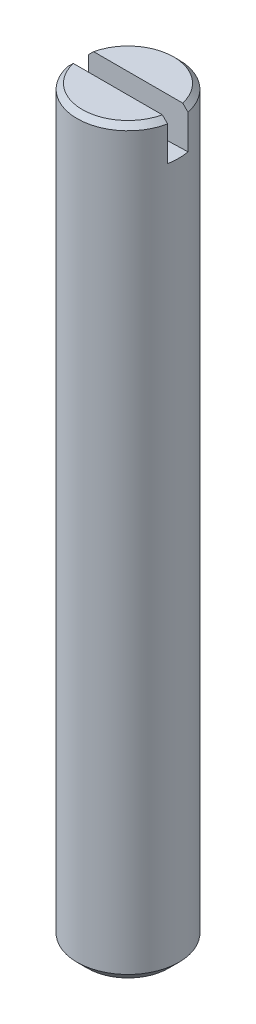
ISO-10303-21;
HEADER;
FILE_DESCRIPTION(('STEP AP214'),'2;1');
FILE_NAME('part.step','',(''),(''),'','','');
FILE_SCHEMA(('AUTOMOTIVE_DESIGN { 1 0 10303 214 1 1 1 1 }'));
ENDSEC;
DATA;
#1=APPLICATION_CONTEXT('core data for automotive mechanical design processes');
#2=APPLICATION_PROTOCOL_DEFINITION('international standard','automotive_design',2000,#1);
#3=PRODUCT_CONTEXT('',#1,'mechanical');
#4=PRODUCT('Part','Part','',(#3));
#5=PRODUCT_RELATED_PRODUCT_CATEGORY('part','',(#4));
#6=PRODUCT_DEFINITION_FORMATION('','',#4);
#7=PRODUCT_DEFINITION_CONTEXT('part definition',#1,'design');
#8=PRODUCT_DEFINITION('design','',#6,#7);
#9=PRODUCT_DEFINITION_SHAPE('','',#8);
#10=(LENGTH_UNIT() NAMED_UNIT(*) SI_UNIT(.MILLI.,.METRE.));
#11=(NAMED_UNIT(*) PLANE_ANGLE_UNIT() SI_UNIT($,.RADIAN.));
#12=(NAMED_UNIT(*) SI_UNIT($,.STERADIAN.) SOLID_ANGLE_UNIT());
#13=UNCERTAINTY_MEASURE_WITH_UNIT(LENGTH_MEASURE(1.E-05),#10,'distance_accuracy_value','');
#14=(GEOMETRIC_REPRESENTATION_CONTEXT(3) GLOBAL_UNCERTAINTY_ASSIGNED_CONTEXT((#13)) GLOBAL_UNIT_ASSIGNED_CONTEXT((#10,
#11,#12)) REPRESENTATION_CONTEXT('',''));
#15=CARTESIAN_POINT('',(0.,0.,0.));
#16=DIRECTION('',(0.,0.,1.));
#17=DIRECTION('',(1.,0.,0.));
#18=AXIS2_PLACEMENT_3D('',#15,#16,#17);
#19=CARTESIAN_POINT('',(0.,52.3,0.3));
#20=DIRECTION('',(0.,0.,-1.));
#21=DIRECTION('',(-1.,0.,0.));
#22=AXIS2_PLACEMENT_3D('',#19,#20,#21);
#23=CYLINDRICAL_SURFACE('',#22,31.5);
#24=CARTESIAN_POINT('',(1.46969384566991,20.8343043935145,-0.3));
#25=CARTESIAN_POINT('',(1.47819327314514,20.8347020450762,-0.258385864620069));
#26=CARTESIAN_POINT('',(1.48491598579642,20.8350188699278,-0.216408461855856));
#27=CARTESIAN_POINT('',(1.49478157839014,20.8354856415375,-0.132020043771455));
#28=CARTESIAN_POINT('',(1.49792328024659,20.8356355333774,-0.0896088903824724));
#29=CARTESIAN_POINT('',(1.50057258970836,20.8357618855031,-0.00538043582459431));
#30=CARTESIAN_POINT('',(1.50013980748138,20.8357411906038,0.036435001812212));
#31=CARTESIAN_POINT('',(1.49578575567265,20.8355338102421,0.119866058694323));
#32=CARTESIAN_POINT('',(1.49186606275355,20.835347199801,0.161481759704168));
#33=CARTESIAN_POINT('',(1.48177716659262,20.8348708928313,0.235411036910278));
#34=CARTESIAN_POINT('',(1.47626595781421,20.8346116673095,0.267815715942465));
#35=CARTESIAN_POINT('',(1.46969384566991,20.8343043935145,0.3));
#36=B_SPLINE_CURVE_WITH_KNOTS('',3,(#24,#25,#26,#27,#28,#29,#30,#31,#32,#33,#34,#35),
.UNSPECIFIED.,.F.,.F.,(4,2,2,2,2,4),(0.,0.127386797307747,0.254815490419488,0.380123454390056,
0.505374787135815,0.603915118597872),.UNSPECIFIED.);
#37=CARTESIAN_POINT('',(1.46969384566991,20.8343043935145,-0.3));
#38=VERTEX_POINT('',#37);
#39=CARTESIAN_POINT('',(1.46969384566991,20.8343043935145,0.3));
#40=VERTEX_POINT('',#39);
#41=EDGE_CURVE('E81',#38,#40,#36,.T.);
#42=ORIENTED_EDGE('',*,*,#41,.F.);
#43=CARTESIAN_POINT('',(0.,52.3,-0.3));
#44=DIRECTION('',(0.,0.,-1.));
#45=DIRECTION('',(-1.,0.,0.));
#46=AXIS2_PLACEMENT_3D('',#43,#44,#45);
#47=CIRCLE('',#46,31.5);
#48=CARTESIAN_POINT('',(-1.46969384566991,20.8343043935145,-0.3));
#49=VERTEX_POINT('',#48);
#50=EDGE_CURVE('E87',#49,#38,#47,.F.);
#51=ORIENTED_EDGE('',*,*,#50,.F.);
#52=CARTESIAN_POINT('',(-1.46969384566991,20.8343043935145,0.3));
#53=CARTESIAN_POINT('',(-1.47819327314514,20.8347020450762,0.258385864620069));
#54=CARTESIAN_POINT('',(-1.48491598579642,20.8350188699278,0.216408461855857));
#55=CARTESIAN_POINT('',(-1.49478157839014,20.8354856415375,0.132020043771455));
#56=CARTESIAN_POINT('',(-1.49792328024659,20.8356355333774,0.089608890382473));
#57=CARTESIAN_POINT('',(-1.50057258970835,20.8357618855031,0.00538043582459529));
#58=CARTESIAN_POINT('',(-1.50013980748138,20.8357411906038,-0.0364350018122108));
#59=CARTESIAN_POINT('',(-1.49578575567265,20.8355338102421,-0.119866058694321));
#60=CARTESIAN_POINT('',(-1.49186606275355,20.835347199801,-0.161481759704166));
#61=CARTESIAN_POINT('',(-1.48177716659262,20.8348708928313,-0.235411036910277));
#62=CARTESIAN_POINT('',(-1.47626595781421,20.8346116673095,-0.267815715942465));
#63=CARTESIAN_POINT('',(-1.46969384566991,20.8343043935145,-0.3));
#64=B_SPLINE_CURVE_WITH_KNOTS('',3,(#52,#53,#54,#55,#56,#57,#58,#59,#60,#61,#62,#63),
.UNSPECIFIED.,.F.,.F.,(4,2,2,2,2,4),(0.,0.127386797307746,0.254815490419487,0.380123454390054,
0.505374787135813,0.603915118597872),.UNSPECIFIED.);
#65=CARTESIAN_POINT('',(-1.46969384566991,20.8343043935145,0.3));
#66=VERTEX_POINT('',#65);
#67=EDGE_CURVE('E18',#66,#49,#64,.T.);
#68=ORIENTED_EDGE('',*,*,#67,.F.);
#69=CARTESIAN_POINT('',(0.,52.3,0.3));
#70=DIRECTION('',(0.,0.,-1.));
#71=DIRECTION('',(-1.,0.,0.));
#72=AXIS2_PLACEMENT_3D('',#69,#70,#71);
#73=CIRCLE('',#72,31.5);
#74=EDGE_CURVE('E80',#66,#40,#73,.F.);
#75=ORIENTED_EDGE('',*,*,#74,.T.);
#76=EDGE_LOOP('',(#42,#51,#68,#75));
#77=FACE_BOUND('',#76,.T.);
#78=ADVANCED_FACE('F14',(#77),#23,.F.);
#79=CARTESIAN_POINT('',(0.,52.3,0.3));
#80=DIRECTION('',(0.,0.,1.));
#81=DIRECTION('',(1.,0.,0.));
#82=AXIS2_PLACEMENT_3D('',#79,#80,#81);
#83=PLANE('',#82);
#84=DIRECTION('',(1.,0.,0.));
#85=VECTOR('',#84,1.);
#86=CARTESIAN_POINT('',(0.,22.,0.3));
#87=LINE('',#86,#85);
#88=CARTESIAN_POINT('',(-1.31265465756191,21.9999999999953,0.3));
#89=VERTEX_POINT('',#88);
#90=CARTESIAN_POINT('',(1.31265465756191,21.9999999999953,0.3));
#91=VERTEX_POINT('',#90);
#92=EDGE_CURVE('E156',#89,#91,#87,.T.);
#93=ORIENTED_EDGE('',*,*,#92,.T.);
#94=CARTESIAN_POINT('',(1.4696938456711,21.8465000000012,0.3));
#95=CARTESIAN_POINT('',(1.44355281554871,21.872116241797,0.3));
#96=CARTESIAN_POINT('',(1.41739570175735,21.8977160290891,0.3));
#97=CARTESIAN_POINT('',(1.36504930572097,21.9488826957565,0.3));
#98=CARTESIAN_POINT('',(1.33886002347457,21.9744495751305,0.3));
#99=CARTESIAN_POINT('',(1.31265465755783,21.9999999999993,0.3));
#100=B_SPLINE_CURVE_WITH_KNOTS('',3,(#94,#95,#96,#97,#98,#99),.UNSPECIFIED.,.F.,.F.,(4,2,4),(0.,
0.109799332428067,0.219598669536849),.UNSPECIFIED.);
#101=CARTESIAN_POINT('',(1.46969384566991,21.8465000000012,0.3));
#102=VERTEX_POINT('',#101);
#103=EDGE_CURVE('E94',#102,#91,#100,.T.);
#104=ORIENTED_EDGE('',*,*,#103,.F.);
#105=DIRECTION('',(0.,1.,0.));
#106=VECTOR('',#105,1.);
#107=CARTESIAN_POINT('',(1.46969384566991,52.3,0.3));
#108=LINE('',#107,#106);
#109=EDGE_CURVE('E92',#40,#102,#108,.T.);
#110=ORIENTED_EDGE('',*,*,#109,.F.);
#111=ORIENTED_EDGE('',*,*,#74,.F.);
#112=DIRECTION('',(0.,1.,0.));
#113=VECTOR('',#112,1.);
#114=CARTESIAN_POINT('',(-1.46969384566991,52.3,0.3));
#115=LINE('',#114,#113);
#116=CARTESIAN_POINT('',(-1.4696938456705,21.8465000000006,0.3));
#117=VERTEX_POINT('',#116);
#118=EDGE_CURVE('E72',#117,#66,#115,.F.);
#119=ORIENTED_EDGE('',*,*,#118,.F.);
#120=CARTESIAN_POINT('',(-1.31265465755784,21.9999999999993,0.3));
#121=CARTESIAN_POINT('',(-1.33886002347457,21.9744495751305,0.3));
#122=CARTESIAN_POINT('',(-1.36504930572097,21.9488826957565,0.3));
#123=CARTESIAN_POINT('',(-1.41739570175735,21.8977160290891,0.3));
#124=CARTESIAN_POINT('',(-1.4435528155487,21.872116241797,0.3));
#125=CARTESIAN_POINT('',(-1.46969384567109,21.8465000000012,0.3));
#126=B_SPLINE_CURVE_WITH_KNOTS('',3,(#120,#121,#122,#123,#124,#125),.UNSPECIFIED.,.F.,.F.,(4,2,
4),(0.,0.109799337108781,0.219598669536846),.UNSPECIFIED.);
#127=EDGE_CURVE('E144',#89,#117,#126,.T.);
#128=ORIENTED_EDGE('',*,*,#127,.F.);
#129=EDGE_LOOP('',(#93,#104,#110,#111,#119,#128));
#130=FACE_BOUND('',#129,.T.);
#131=ADVANCED_FACE('F90',(#130),#83,.F.);
#132=CARTESIAN_POINT('',(0.,52.3,-0.3));
#133=DIRECTION('',(0.,0.,1.));
#134=DIRECTION('',(1.,0.,0.));
#135=AXIS2_PLACEMENT_3D('',#132,#133,#134);
#136=PLANE('',#135);
#137=DIRECTION('',(1.,0.,0.));
#138=VECTOR('',#137,1.);
#139=CARTESIAN_POINT('',(0.,22.,-0.3));
#140=LINE('',#139,#138);
#141=CARTESIAN_POINT('',(1.31265465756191,21.9999999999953,-0.3));
#142=VERTEX_POINT('',#141);
#143=CARTESIAN_POINT('',(-1.31265465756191,21.9999999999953,-0.3));
#144=VERTEX_POINT('',#143);
#145=EDGE_CURVE('E158',#142,#144,#140,.F.);
#146=ORIENTED_EDGE('',*,*,#145,.T.);
#147=CARTESIAN_POINT('',(-1.31265465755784,21.9999999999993,-0.3));
#148=CARTESIAN_POINT('',(-1.33886002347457,21.9744495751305,-0.3));
#149=CARTESIAN_POINT('',(-1.36504930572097,21.9488826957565,-0.3));
#150=CARTESIAN_POINT('',(-1.41739570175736,21.8977160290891,-0.3));
#151=CARTESIAN_POINT('',(-1.44355281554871,21.872116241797,-0.3));
#152=CARTESIAN_POINT('',(-1.4696938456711,21.8465000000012,-0.3));
#153=B_SPLINE_CURVE_WITH_KNOTS('',3,(#147,#148,#149,#150,#151,#152),.UNSPECIFIED.,.F.,.F.,(4,2,
4),(0.,0.109799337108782,0.219598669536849),.UNSPECIFIED.);
#154=CARTESIAN_POINT('',(-1.46969384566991,21.8465000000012,-0.3));
#155=VERTEX_POINT('',#154);
#156=EDGE_CURVE('E38',#144,#155,#153,.T.);
#157=ORIENTED_EDGE('',*,*,#156,.T.);
#158=DIRECTION('',(0.,1.,0.));
#159=VECTOR('',#158,1.);
#160=CARTESIAN_POINT('',(-1.46969384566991,52.3,-0.3));
#161=LINE('',#160,#159);
#162=EDGE_CURVE('E149',#155,#49,#161,.F.);
#163=ORIENTED_EDGE('',*,*,#162,.T.);
#164=ORIENTED_EDGE('',*,*,#50,.T.);
#165=DIRECTION('',(0.,1.,0.));
#166=VECTOR('',#165,1.);
#167=CARTESIAN_POINT('',(1.46969384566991,52.3,-0.3));
#168=LINE('',#167,#166);
#169=CARTESIAN_POINT('',(1.4696938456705,21.8465000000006,-0.3));
#170=VERTEX_POINT('',#169);
#171=EDGE_CURVE('E132',#38,#170,#168,.T.);
#172=ORIENTED_EDGE('',*,*,#171,.T.);
#173=CARTESIAN_POINT('',(1.46969384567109,21.8465000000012,-0.3));
#174=CARTESIAN_POINT('',(1.4435528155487,21.872116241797,-0.3));
#175=CARTESIAN_POINT('',(1.41739570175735,21.8977160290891,-0.3));
#176=CARTESIAN_POINT('',(1.36504930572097,21.9488826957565,-0.3));
#177=CARTESIAN_POINT('',(1.33886002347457,21.9744495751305,-0.3));
#178=CARTESIAN_POINT('',(1.31265465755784,21.9999999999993,-0.3));
#179=B_SPLINE_CURVE_WITH_KNOTS('',3,(#173,#174,#175,#176,#177,#178),.UNSPECIFIED.,.F.,.F.,(4,2,
4),(0.,0.109799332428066,0.219598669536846),.UNSPECIFIED.);
#180=EDGE_CURVE('E126',#170,#142,#179,.T.);
#181=ORIENTED_EDGE('',*,*,#180,.T.);
#182=EDGE_LOOP('',(#146,#157,#163,#164,#172,#181));
#183=FACE_BOUND('',#182,.T.);
#184=ADVANCED_FACE('F133',(#183),#136,.T.);
#185=CARTESIAN_POINT('',(1.1935,0.,0.));
#186=DIRECTION('',(0.,1.,0.));
#187=DIRECTION('',(0.,0.,1.));
#188=AXIS2_PLACEMENT_3D('',#185,#186,#187);
#189=PLANE('',#188);
#190=CARTESIAN_POINT('',(0.,0.,0.));
#191=DIRECTION('',(0.,1.,0.));
#192=DIRECTION('',(0.,0.,1.));
#193=AXIS2_PLACEMENT_3D('',#190,#191,#192);
#194=CIRCLE('',#193,1.19350000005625);
#195=CARTESIAN_POINT('',(0.,0.,1.19350000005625));
#196=VERTEX_POINT('',#195);
#197=EDGE_CURVE('E162',#196,#196,#194,.T.);
#198=ORIENTED_EDGE('',*,*,#197,.F.);
#199=EDGE_LOOP('',(#198));
#200=FACE_BOUND('',#199,.T.);
#201=ADVANCED_FACE('F137',(#200),#189,.F.);
#202=CARTESIAN_POINT('',(0.,22.,0.));
#203=DIRECTION('',(0.,-1.,0.));
#204=DIRECTION('',(0.,0.,-1.));
#205=AXIS2_PLACEMENT_3D('',#202,#203,#204);
#206=PLANE('',#205);
#207=ORIENTED_EDGE('',*,*,#92,.F.);
#208=CARTESIAN_POINT('',(0.,21.9999999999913,0.));
#209=DIRECTION('',(0.,-1.,0.));
#210=DIRECTION('',(0.,0.,-1.));
#211=AXIS2_PLACEMENT_3D('',#208,#209,#210);
#212=CIRCLE('',#211,1.34650000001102);
#213=EDGE_CURVE('E154',#91,#89,#212,.T.);
#214=ORIENTED_EDGE('',*,*,#213,.F.);
#215=EDGE_LOOP('',(#207,#214));
#216=FACE_BOUND('',#215,.T.);
#217=ADVANCED_FACE('F160',(#216),#206,.F.);
#218=CARTESIAN_POINT('',(0.,22.,0.));
#219=DIRECTION('',(0.,-1.,0.));
#220=DIRECTION('',(0.,0.,-1.));
#221=AXIS2_PLACEMENT_3D('',#218,#219,#220);
#222=PLANE('',#221);
#223=CARTESIAN_POINT('',(0.,21.9999999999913,0.));
#224=DIRECTION('',(0.,-1.,0.));
#225=DIRECTION('',(0.,0.,-1.));
#226=AXIS2_PLACEMENT_3D('',#223,#224,#225);
#227=CIRCLE('',#226,1.34650000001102);
#228=EDGE_CURVE('E161',#144,#142,#227,.T.);
#229=ORIENTED_EDGE('',*,*,#228,.F.);
#230=ORIENTED_EDGE('',*,*,#145,.F.);
#231=EDGE_LOOP('',(#229,#230));
#232=FACE_BOUND('',#231,.T.);
#233=ADVANCED_FACE('F182',(#232),#222,.F.);
#234=CARTESIAN_POINT('',(0.,0.306499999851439,0.));
#235=DIRECTION('',(0.,1.,0.));
#236=DIRECTION('',(0.,0.,1.));
#237=AXIS2_PLACEMENT_3D('',#234,#235,#236);
#238=CONICAL_SURFACE('',#237,1.49999999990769,0.785398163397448);
#239=CARTESIAN_POINT('',(0.,0.3065,0.));
#240=DIRECTION('',(0.,-1.,0.));
#241=DIRECTION('',(0.,0.,-1.));
#242=AXIS2_PLACEMENT_3D('',#239,#240,#241);
#243=CIRCLE('',#242,1.5);
#244=CARTESIAN_POINT('',(0.,0.3065,-1.5));
#245=VERTEX_POINT('',#244);
#246=EDGE_CURVE('E164',#245,#245,#243,.F.);
#247=ORIENTED_EDGE('',*,*,#246,.F.);
#248=EDGE_LOOP('',(#247));
#249=FACE_BOUND('',#248,.T.);
#250=ORIENTED_EDGE('',*,*,#197,.T.);
#251=EDGE_LOOP('',(#250));
#252=FACE_BOUND('',#251,.T.);
#253=ADVANCED_FACE('F179',(#249,#252),#238,.T.);
#254=CARTESIAN_POINT('',(0.,21.846499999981,0.));
#255=DIRECTION('',(0.,-1.,0.));
#256=DIRECTION('',(0.,0.,-1.));
#257=AXIS2_PLACEMENT_3D('',#254,#255,#256);
#258=CONICAL_SURFACE('',#257,1.50000000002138,0.785398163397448);
#259=ORIENTED_EDGE('',*,*,#213,.T.);
#260=ORIENTED_EDGE('',*,*,#127,.T.);
#261=CARTESIAN_POINT('',(0.,21.8465,0.));
#262=DIRECTION('',(0.,-1.,0.));
#263=DIRECTION('',(0.,0.,-1.));
#264=AXIS2_PLACEMENT_3D('',#261,#262,#263);
#265=CIRCLE('',#264,1.5);
#266=EDGE_CURVE('E29',#102,#117,#265,.T.);
#267=ORIENTED_EDGE('',*,*,#266,.F.);
#268=ORIENTED_EDGE('',*,*,#103,.T.);
#269=EDGE_LOOP('',(#259,#260,#267,#268));
#270=FACE_BOUND('',#269,.T.);
#271=ADVANCED_FACE('F114',(#270),#258,.T.);
#272=CARTESIAN_POINT('',(0.,21.846499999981,0.));
#273=DIRECTION('',(0.,-1.,0.));
#274=DIRECTION('',(0.,0.,-1.));
#275=AXIS2_PLACEMENT_3D('',#272,#273,#274);
#276=CONICAL_SURFACE('',#275,1.50000000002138,0.785398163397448);
#277=ORIENTED_EDGE('',*,*,#156,.F.);
#278=ORIENTED_EDGE('',*,*,#228,.T.);
#279=ORIENTED_EDGE('',*,*,#180,.F.);
#280=CARTESIAN_POINT('',(0.,21.8465,0.));
#281=DIRECTION('',(0.,-1.,0.));
#282=DIRECTION('',(0.,0.,-1.));
#283=AXIS2_PLACEMENT_3D('',#280,#281,#282);
#284=CIRCLE('',#283,1.5);
#285=EDGE_CURVE('E9',#155,#170,#284,.T.);
#286=ORIENTED_EDGE('',*,*,#285,.F.);
#287=EDGE_LOOP('',(#277,#278,#279,#286));
#288=FACE_BOUND('',#287,.T.);
#289=ADVANCED_FACE('F110',(#288),#276,.T.);
#290=CARTESIAN_POINT('',(0.,15.,0.));
#291=DIRECTION('',(0.,-1.,0.));
#292=DIRECTION('',(0.,0.,-1.));
#293=AXIS2_PLACEMENT_3D('',#290,#291,#292);
#294=CYLINDRICAL_SURFACE('',#293,1.5);
#295=ORIENTED_EDGE('',*,*,#41,.T.);
#296=ORIENTED_EDGE('',*,*,#109,.T.);
#297=ORIENTED_EDGE('',*,*,#266,.T.);
#298=ORIENTED_EDGE('',*,*,#118,.T.);
#299=ORIENTED_EDGE('',*,*,#67,.T.);
#300=ORIENTED_EDGE('',*,*,#162,.F.);
#301=ORIENTED_EDGE('',*,*,#285,.T.);
#302=ORIENTED_EDGE('',*,*,#171,.F.);
#303=EDGE_LOOP('',(#295,#296,#297,#298,#299,#300,#301,#302));
#304=FACE_BOUND('',#303,.T.);
#305=ORIENTED_EDGE('',*,*,#246,.T.);
#306=EDGE_LOOP('',(#305));
#307=FACE_BOUND('',#306,.T.);
#308=ADVANCED_FACE('F74',(#304,#307),#294,.T.);
#309=CLOSED_SHELL('',(#78,#131,#184,#201,#217,#233,#253,#271,#289,#308));
#310=MANIFOLD_SOLID_BREP('B1',#309);
#311=ADVANCED_BREP_SHAPE_REPRESENTATION('',(#18,#310),#14);
#312=SHAPE_DEFINITION_REPRESENTATION(#9,#311);
ENDSEC;
END-ISO-10303-21;
